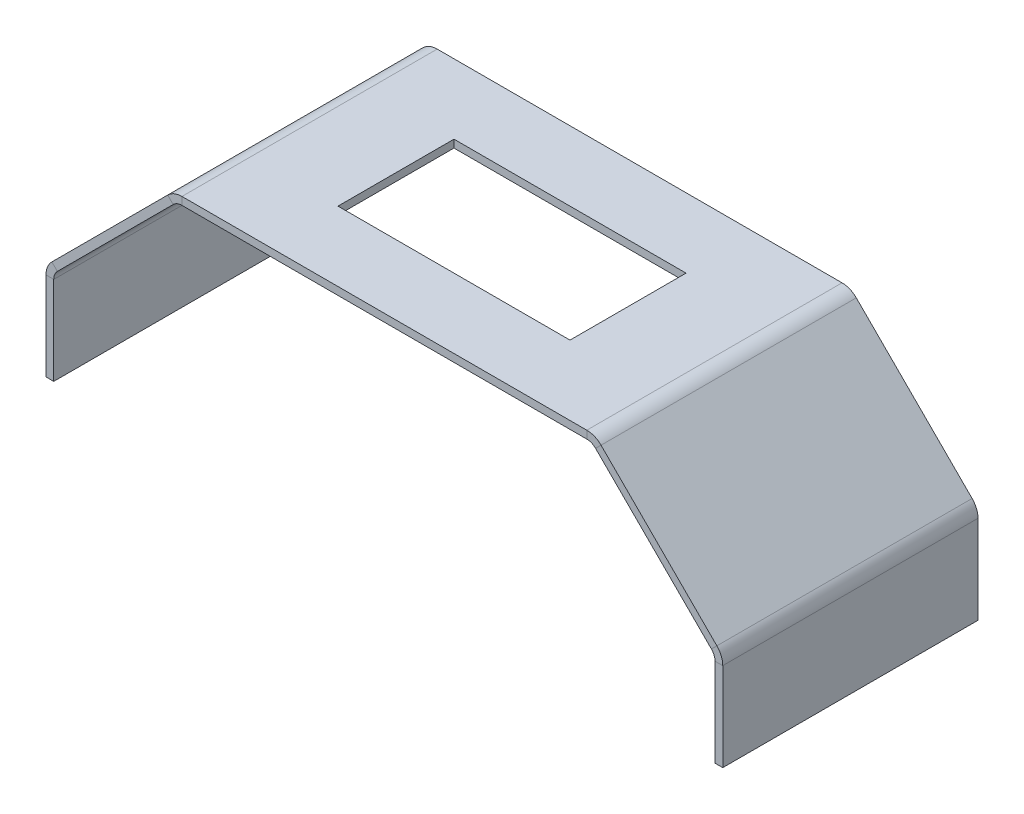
ISO-10303-21;
HEADER;
FILE_DESCRIPTION(('STEP AP214'),'2;1');
FILE_NAME('part.step','',(''),(''),'','','');
FILE_SCHEMA(('AUTOMOTIVE_DESIGN { 1 0 10303 214 1 1 1 1 }'));
ENDSEC;
DATA;
#1=APPLICATION_CONTEXT('core data for automotive mechanical design processes');
#2=APPLICATION_PROTOCOL_DEFINITION('international standard','automotive_design',2000,#1);
#3=PRODUCT_CONTEXT('',#1,'mechanical');
#4=PRODUCT('Part','Part','',(#3));
#5=PRODUCT_RELATED_PRODUCT_CATEGORY('part','',(#4));
#6=PRODUCT_DEFINITION_FORMATION('','',#4);
#7=PRODUCT_DEFINITION_CONTEXT('part definition',#1,'design');
#8=PRODUCT_DEFINITION('design','',#6,#7);
#9=PRODUCT_DEFINITION_SHAPE('','',#8);
#10=(LENGTH_UNIT() NAMED_UNIT(*) SI_UNIT(.MILLI.,.METRE.));
#11=(NAMED_UNIT(*) PLANE_ANGLE_UNIT() SI_UNIT($,.RADIAN.));
#12=(NAMED_UNIT(*) SI_UNIT($,.STERADIAN.) SOLID_ANGLE_UNIT());
#13=UNCERTAINTY_MEASURE_WITH_UNIT(LENGTH_MEASURE(1.E-05),#10,'distance_accuracy_value','');
#14=(GEOMETRIC_REPRESENTATION_CONTEXT(3) GLOBAL_UNCERTAINTY_ASSIGNED_CONTEXT((#13)) GLOBAL_UNIT_ASSIGNED_CONTEXT((#10,
#11,#12)) REPRESENTATION_CONTEXT('',''));
#15=CARTESIAN_POINT('',(0.,0.,0.));
#16=DIRECTION('',(0.,0.,1.));
#17=DIRECTION('',(1.,0.,0.));
#18=AXIS2_PLACEMENT_3D('',#15,#16,#17);
#19=CARTESIAN_POINT('',(1.52304473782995,26.52304473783,66.));
#20=DIRECTION('',(0.,0.,1.));
#21=DIRECTION('',(1.,0.,0.));
#22=AXIS2_PLACEMENT_3D('',#19,#20,#21);
#23=PLANE('',#22);
#24=DIRECTION('',(0.707106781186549,-0.707106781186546,0.));
#25=VECTOR('',#24,1.);
#26=CARTESIAN_POINT('',(1.52304473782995,26.52304473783,66.));
#27=LINE('',#26,#25);
#28=CARTESIAN_POINT('',(1.52304473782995,26.52304473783,66.));
#29=VERTEX_POINT('',#28);
#30=CARTESIAN_POINT('',(2.93725830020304,25.1088311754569,66.));
#31=VERTEX_POINT('',#30);
#32=EDGE_CURVE('E428',#29,#31,#27,.T.);
#33=ORIENTED_EDGE('',*,*,#32,.F.);
#34=CARTESIAN_POINT('',(5.2,22.8460894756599,66.));
#35=DIRECTION('',(0.,0.,1.));
#36=DIRECTION('',(1.,0.,0.));
#37=AXIS2_PLACEMENT_3D('',#34,#35,#36);
#38=CIRCLE('',#37,5.2);
#39=CARTESIAN_POINT('',(0.,22.8460894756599,66.));
#40=VERTEX_POINT('',#39);
#41=EDGE_CURVE('E251',#40,#29,#38,.F.);
#42=ORIENTED_EDGE('',*,*,#41,.F.);
#43=DIRECTION('',(-1.,0.,0.));
#44=VECTOR('',#43,1.);
#45=CARTESIAN_POINT('',(2.,22.8460894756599,66.));
#46=LINE('',#45,#44);
#47=CARTESIAN_POINT('',(2.,22.8460894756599,66.));
#48=VERTEX_POINT('',#47);
#49=EDGE_CURVE('E426',#48,#40,#46,.T.);
#50=ORIENTED_EDGE('',*,*,#49,.F.);
#51=CARTESIAN_POINT('',(5.2,22.8460894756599,66.));
#52=DIRECTION('',(0.,0.,1.));
#53=DIRECTION('',(1.,0.,0.));
#54=AXIS2_PLACEMENT_3D('',#51,#52,#53);
#55=CIRCLE('',#54,3.2);
#56=EDGE_CURVE('E263',#48,#31,#55,.F.);
#57=ORIENTED_EDGE('',*,*,#56,.T.);
#58=EDGE_LOOP('',(#33,#42,#50,#57));
#59=FACE_BOUND('',#58,.T.);
#60=ADVANCED_FACE('F35',(#59),#23,.T.);
#61=CARTESIAN_POINT('',(2.,22.8460894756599,66.));
#62=DIRECTION('',(0.,0.,1.));
#63=DIRECTION('',(1.,0.,0.));
#64=AXIS2_PLACEMENT_3D('',#61,#62,#63);
#65=PLANE('',#64);
#66=DIRECTION('',(0.707106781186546,0.707106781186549,0.));
#67=VECTOR('',#66,1.);
#68=CARTESIAN_POINT('',(0.,25.,66.));
#69=LINE('',#68,#67);
#70=CARTESIAN_POINT('',(31.4769552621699,56.4769552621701,66.));
#71=VERTEX_POINT('',#70);
#72=EDGE_CURVE('E248',#29,#71,#69,.T.);
#73=ORIENTED_EDGE('',*,*,#72,.F.);
#74=ORIENTED_EDGE('',*,*,#32,.T.);
#75=DIRECTION('',(0.707106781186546,0.707106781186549,0.));
#76=VECTOR('',#75,1.);
#77=CARTESIAN_POINT('',(1.4142135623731,23.5857864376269,66.));
#78=LINE('',#77,#76);
#79=CARTESIAN_POINT('',(32.891168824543,55.062741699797,66.));
#80=VERTEX_POINT('',#79);
#81=EDGE_CURVE('E266',#31,#80,#78,.T.);
#82=ORIENTED_EDGE('',*,*,#81,.T.);
#83=DIRECTION('',(-0.707106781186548,0.707106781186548,0.));
#84=VECTOR('',#83,1.);
#85=CARTESIAN_POINT('',(32.891168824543,55.062741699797,66.));
#86=LINE('',#85,#84);
#87=EDGE_CURVE('E418',#80,#71,#86,.T.);
#88=ORIENTED_EDGE('',*,*,#87,.T.);
#89=EDGE_LOOP('',(#73,#74,#82,#88));
#90=FACE_BOUND('',#89,.T.);
#91=ADVANCED_FACE('F454',(#90),#65,.T.);
#92=CARTESIAN_POINT('',(0.,22.8460894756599,0.));
#93=DIRECTION('',(0.,0.,-1.));
#94=DIRECTION('',(-1.,0.,0.));
#95=AXIS2_PLACEMENT_3D('',#92,#93,#94);
#96=PLANE('',#95);
#97=DIRECTION('',(1.,0.,0.));
#98=VECTOR('',#97,1.);
#99=CARTESIAN_POINT('',(0.,22.8460894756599,0.));
#100=LINE('',#99,#98);
#101=CARTESIAN_POINT('',(0.,22.8460894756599,0.));
#102=VERTEX_POINT('',#101);
#103=CARTESIAN_POINT('',(2.,22.8460894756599,0.));
#104=VERTEX_POINT('',#103);
#105=EDGE_CURVE('E424',#102,#104,#100,.T.);
#106=ORIENTED_EDGE('',*,*,#105,.F.);
#107=CARTESIAN_POINT('',(5.2,22.8460894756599,0.));
#108=DIRECTION('',(0.,0.,1.));
#109=DIRECTION('',(1.,0.,0.));
#110=AXIS2_PLACEMENT_3D('',#107,#108,#109);
#111=CIRCLE('',#110,5.2);
#112=CARTESIAN_POINT('',(1.52304473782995,26.52304473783,0.));
#113=VERTEX_POINT('',#112);
#114=EDGE_CURVE('E311',#102,#113,#111,.F.);
#115=ORIENTED_EDGE('',*,*,#114,.T.);
#116=DIRECTION('',(-0.707106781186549,0.707106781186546,0.));
#117=VECTOR('',#116,1.);
#118=CARTESIAN_POINT('',(2.93725830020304,25.1088311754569,0.));
#119=LINE('',#118,#117);
#120=CARTESIAN_POINT('',(2.93725830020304,25.1088311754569,0.));
#121=VERTEX_POINT('',#120);
#122=EDGE_CURVE('E422',#121,#113,#119,.T.);
#123=ORIENTED_EDGE('',*,*,#122,.F.);
#124=CARTESIAN_POINT('',(5.2,22.8460894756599,0.));
#125=DIRECTION('',(0.,0.,1.));
#126=DIRECTION('',(1.,0.,0.));
#127=AXIS2_PLACEMENT_3D('',#124,#125,#126);
#128=CIRCLE('',#127,3.2);
#129=EDGE_CURVE('E323',#104,#121,#128,.F.);
#130=ORIENTED_EDGE('',*,*,#129,.F.);
#131=EDGE_LOOP('',(#106,#115,#123,#130));
#132=FACE_BOUND('',#131,.T.);
#133=ADVANCED_FACE('F459',(#132),#96,.T.);
#134=CARTESIAN_POINT('',(2.93725830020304,25.1088311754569,0.));
#135=DIRECTION('',(0.,0.,-1.));
#136=DIRECTION('',(-1.,0.,0.));
#137=AXIS2_PLACEMENT_3D('',#134,#135,#136);
#138=PLANE('',#137);
#139=DIRECTION('',(0.,1.,0.));
#140=VECTOR('',#139,1.);
#141=CARTESIAN_POINT('',(0.,0.,0.));
#142=LINE('',#141,#140);
#143=CARTESIAN_POINT('',(0.,0.,0.));
#144=VERTEX_POINT('',#143);
#145=EDGE_CURVE('E314',#144,#102,#142,.T.);
#146=ORIENTED_EDGE('',*,*,#145,.T.);
#147=ORIENTED_EDGE('',*,*,#105,.T.);
#148=DIRECTION('',(0.,1.,0.));
#149=VECTOR('',#148,1.);
#150=CARTESIAN_POINT('',(2.,0.,0.));
#151=LINE('',#150,#149);
#152=CARTESIAN_POINT('',(2.,0.,0.));
#153=VERTEX_POINT('',#152);
#154=EDGE_CURVE('E320',#153,#104,#151,.T.);
#155=ORIENTED_EDGE('',*,*,#154,.F.);
#156=DIRECTION('',(-1.,0.,0.));
#157=VECTOR('',#156,1.);
#158=CARTESIAN_POINT('',(2.,0.,0.));
#159=LINE('',#158,#157);
#160=EDGE_CURVE('E317',#153,#144,#159,.T.);
#161=ORIENTED_EDGE('',*,*,#160,.T.);
#162=EDGE_LOOP('',(#146,#147,#155,#161));
#163=FACE_BOUND('',#162,.T.);
#164=ADVANCED_FACE('F515',(#163),#138,.T.);
#165=CARTESIAN_POINT('',(35.15391052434,58.,66.));
#166=DIRECTION('',(0.,0.,1.));
#167=DIRECTION('',(1.,0.,0.));
#168=AXIS2_PLACEMENT_3D('',#165,#166,#167);
#169=PLANE('',#168);
#170=DIRECTION('',(0.,-1.,0.));
#171=VECTOR('',#170,1.);
#172=CARTESIAN_POINT('',(35.15391052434,58.,66.));
#173=LINE('',#172,#171);
#174=CARTESIAN_POINT('',(35.15391052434,58.,66.));
#175=VERTEX_POINT('',#174);
#176=CARTESIAN_POINT('',(35.15391052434,56.,66.));
#177=VERTEX_POINT('',#176);
#178=EDGE_CURVE('E420',#175,#177,#173,.T.);
#179=ORIENTED_EDGE('',*,*,#178,.F.);
#180=CARTESIAN_POINT('',(35.15391052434,52.8,66.));
#181=DIRECTION('',(0.,0.,1.));
#182=DIRECTION('',(1.,0.,0.));
#183=AXIS2_PLACEMENT_3D('',#180,#181,#182);
#184=CIRCLE('',#183,5.2);
#185=EDGE_CURVE('E245',#71,#175,#184,.F.);
#186=ORIENTED_EDGE('',*,*,#185,.F.);
#187=ORIENTED_EDGE('',*,*,#87,.F.);
#188=CARTESIAN_POINT('',(35.15391052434,52.8,66.));
#189=DIRECTION('',(0.,0.,1.));
#190=DIRECTION('',(1.,0.,0.));
#191=AXIS2_PLACEMENT_3D('',#188,#189,#190);
#192=CIRCLE('',#191,3.2);
#193=EDGE_CURVE('E269',#80,#177,#192,.F.);
#194=ORIENTED_EDGE('',*,*,#193,.T.);
#195=EDGE_LOOP('',(#179,#186,#187,#194));
#196=FACE_BOUND('',#195,.T.);
#197=ADVANCED_FACE('F503',(#196),#169,.T.);
#198=CARTESIAN_POINT('',(32.891168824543,55.062741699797,66.));
#199=DIRECTION('',(0.,0.,1.));
#200=DIRECTION('',(1.,0.,0.));
#201=AXIS2_PLACEMENT_3D('',#198,#199,#200);
#202=PLANE('',#201);
#203=DIRECTION('',(1.,0.,0.));
#204=VECTOR('',#203,1.);
#205=CARTESIAN_POINT('',(32.9999999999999,58.,66.));
#206=LINE('',#205,#204);
#207=CARTESIAN_POINT('',(139.84608947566,58.,66.));
#208=VERTEX_POINT('',#207);
#209=EDGE_CURVE('E242',#175,#208,#206,.T.);
#210=ORIENTED_EDGE('',*,*,#209,.F.);
#211=ORIENTED_EDGE('',*,*,#178,.T.);
#212=DIRECTION('',(1.,0.,0.));
#213=VECTOR('',#212,1.);
#214=CARTESIAN_POINT('',(32.9999999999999,56.,66.));
#215=LINE('',#214,#213);
#216=CARTESIAN_POINT('',(139.84608947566,56.,66.));
#217=VERTEX_POINT('',#216);
#218=EDGE_CURVE('E272',#177,#217,#215,.T.);
#219=ORIENTED_EDGE('',*,*,#218,.T.);
#220=DIRECTION('',(0.,1.,0.));
#221=VECTOR('',#220,1.);
#222=CARTESIAN_POINT('',(139.84608947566,56.,66.));
#223=LINE('',#222,#221);
#224=EDGE_CURVE('E410',#217,#208,#223,.T.);
#225=ORIENTED_EDGE('',*,*,#224,.T.);
#226=EDGE_LOOP('',(#210,#211,#219,#225));
#227=FACE_BOUND('',#226,.T.);
#228=ADVANCED_FACE('F522',(#227),#202,.T.);
#229=CARTESIAN_POINT('',(31.4769552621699,56.4769552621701,0.));
#230=DIRECTION('',(0.,0.,-1.));
#231=DIRECTION('',(-1.,0.,0.));
#232=AXIS2_PLACEMENT_3D('',#229,#230,#231);
#233=PLANE('',#232);
#234=DIRECTION('',(0.707106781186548,-0.707106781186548,0.));
#235=VECTOR('',#234,1.);
#236=CARTESIAN_POINT('',(31.4769552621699,56.4769552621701,0.));
#237=LINE('',#236,#235);
#238=CARTESIAN_POINT('',(31.4769552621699,56.4769552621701,0.));
#239=VERTEX_POINT('',#238);
#240=CARTESIAN_POINT('',(32.891168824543,55.062741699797,0.));
#241=VERTEX_POINT('',#240);
#242=EDGE_CURVE('E416',#239,#241,#237,.T.);
#243=ORIENTED_EDGE('',*,*,#242,.F.);
#244=CARTESIAN_POINT('',(35.15391052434,52.8,0.));
#245=DIRECTION('',(0.,0.,1.));
#246=DIRECTION('',(1.,0.,0.));
#247=AXIS2_PLACEMENT_3D('',#244,#245,#246);
#248=CIRCLE('',#247,5.2);
#249=CARTESIAN_POINT('',(35.15391052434,58.,0.));
#250=VERTEX_POINT('',#249);
#251=EDGE_CURVE('E305',#239,#250,#248,.F.);
#252=ORIENTED_EDGE('',*,*,#251,.T.);
#253=DIRECTION('',(0.,1.,0.));
#254=VECTOR('',#253,1.);
#255=CARTESIAN_POINT('',(35.15391052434,56.,0.));
#256=LINE('',#255,#254);
#257=CARTESIAN_POINT('',(35.15391052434,56.,0.));
#258=VERTEX_POINT('',#257);
#259=EDGE_CURVE('E414',#258,#250,#256,.T.);
#260=ORIENTED_EDGE('',*,*,#259,.F.);
#261=CARTESIAN_POINT('',(35.15391052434,52.8,0.));
#262=DIRECTION('',(0.,0.,1.));
#263=DIRECTION('',(1.,0.,0.));
#264=AXIS2_PLACEMENT_3D('',#261,#262,#263);
#265=CIRCLE('',#264,3.2);
#266=EDGE_CURVE('E329',#241,#258,#265,.F.);
#267=ORIENTED_EDGE('',*,*,#266,.F.);
#268=EDGE_LOOP('',(#243,#252,#260,#267));
#269=FACE_BOUND('',#268,.T.);
#270=ADVANCED_FACE('F528',(#269),#233,.T.);
#271=CARTESIAN_POINT('',(35.15391052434,56.,0.));
#272=DIRECTION('',(0.,0.,-1.));
#273=DIRECTION('',(-1.,0.,0.));
#274=AXIS2_PLACEMENT_3D('',#271,#272,#273);
#275=PLANE('',#274);
#276=DIRECTION('',(0.707106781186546,0.707106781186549,0.));
#277=VECTOR('',#276,1.);
#278=CARTESIAN_POINT('',(0.,25.,0.));
#279=LINE('',#278,#277);
#280=EDGE_CURVE('E308',#113,#239,#279,.T.);
#281=ORIENTED_EDGE('',*,*,#280,.T.);
#282=ORIENTED_EDGE('',*,*,#242,.T.);
#283=DIRECTION('',(0.707106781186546,0.707106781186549,0.));
#284=VECTOR('',#283,1.);
#285=CARTESIAN_POINT('',(1.4142135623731,23.5857864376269,0.));
#286=LINE('',#285,#284);
#287=EDGE_CURVE('E326',#121,#241,#286,.T.);
#288=ORIENTED_EDGE('',*,*,#287,.F.);
#289=ORIENTED_EDGE('',*,*,#122,.T.);
#290=EDGE_LOOP('',(#281,#282,#288,#289));
#291=FACE_BOUND('',#290,.T.);
#292=ADVANCED_FACE('F512',(#291),#275,.T.);
#293=CARTESIAN_POINT('',(143.52304473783,56.47695526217,66.));
#294=DIRECTION('',(0.,0.,1.));
#295=DIRECTION('',(1.,0.,0.));
#296=AXIS2_PLACEMENT_3D('',#293,#294,#295);
#297=PLANE('',#296);
#298=DIRECTION('',(-0.707106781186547,-0.707106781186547,0.));
#299=VECTOR('',#298,1.);
#300=CARTESIAN_POINT('',(143.52304473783,56.47695526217,66.));
#301=LINE('',#300,#299);
#302=CARTESIAN_POINT('',(143.52304473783,56.47695526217,66.));
#303=VERTEX_POINT('',#302);
#304=CARTESIAN_POINT('',(142.108831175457,55.0627416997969,66.));
#305=VERTEX_POINT('',#304);
#306=EDGE_CURVE('E412',#303,#305,#301,.T.);
#307=ORIENTED_EDGE('',*,*,#306,.F.);
#308=CARTESIAN_POINT('',(139.84608947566,52.8,66.));
#309=DIRECTION('',(0.,0.,1.));
#310=DIRECTION('',(1.,0.,0.));
#311=AXIS2_PLACEMENT_3D('',#308,#309,#310);
#312=CIRCLE('',#311,5.2);
#313=EDGE_CURVE('E239',#208,#303,#312,.F.);
#314=ORIENTED_EDGE('',*,*,#313,.F.);
#315=ORIENTED_EDGE('',*,*,#224,.F.);
#316=CARTESIAN_POINT('',(139.84608947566,52.8,66.));
#317=DIRECTION('',(0.,0.,1.));
#318=DIRECTION('',(1.,0.,0.));
#319=AXIS2_PLACEMENT_3D('',#316,#317,#318);
#320=CIRCLE('',#319,3.2);
#321=EDGE_CURVE('E275',#217,#305,#320,.F.);
#322=ORIENTED_EDGE('',*,*,#321,.T.);
#323=EDGE_LOOP('',(#307,#314,#315,#322));
#324=FACE_BOUND('',#323,.T.);
#325=ADVANCED_FACE('F534',(#324),#297,.T.);
#326=CARTESIAN_POINT('',(139.84608947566,56.,66.));
#327=DIRECTION('',(0.,0.,1.));
#328=DIRECTION('',(1.,0.,0.));
#329=AXIS2_PLACEMENT_3D('',#326,#327,#328);
#330=PLANE('',#329);
#331=DIRECTION('',(0.707106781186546,-0.707106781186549,0.));
#332=VECTOR('',#331,1.);
#333=CARTESIAN_POINT('',(142.,58.,66.));
#334=LINE('',#333,#332);
#335=CARTESIAN_POINT('',(173.47695526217,26.52304473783,66.));
#336=VERTEX_POINT('',#335);
#337=EDGE_CURVE('E236',#303,#336,#334,.T.);
#338=ORIENTED_EDGE('',*,*,#337,.F.);
#339=ORIENTED_EDGE('',*,*,#306,.T.);
#340=DIRECTION('',(0.707106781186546,-0.707106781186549,0.));
#341=VECTOR('',#340,1.);
#342=CARTESIAN_POINT('',(140.585786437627,56.5857864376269,66.));
#343=LINE('',#342,#341);
#344=CARTESIAN_POINT('',(172.062741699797,25.1088311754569,66.));
#345=VERTEX_POINT('',#344);
#346=EDGE_CURVE('E278',#305,#345,#343,.T.);
#347=ORIENTED_EDGE('',*,*,#346,.T.);
#348=DIRECTION('',(0.707106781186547,0.707106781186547,0.));
#349=VECTOR('',#348,1.);
#350=CARTESIAN_POINT('',(172.062741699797,25.1088311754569,66.));
#351=LINE('',#350,#349);
#352=EDGE_CURVE('E402',#345,#336,#351,.T.);
#353=ORIENTED_EDGE('',*,*,#352,.T.);
#354=EDGE_LOOP('',(#338,#339,#347,#353));
#355=FACE_BOUND('',#354,.T.);
#356=ADVANCED_FACE('F537',(#355),#330,.T.);
#357=CARTESIAN_POINT('',(139.84608947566,58.,0.));
#358=DIRECTION('',(0.,0.,-1.));
#359=DIRECTION('',(-1.,0.,0.));
#360=AXIS2_PLACEMENT_3D('',#357,#358,#359);
#361=PLANE('',#360);
#362=DIRECTION('',(0.,-1.,0.));
#363=VECTOR('',#362,1.);
#364=CARTESIAN_POINT('',(139.84608947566,58.,0.));
#365=LINE('',#364,#363);
#366=CARTESIAN_POINT('',(139.84608947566,58.,0.));
#367=VERTEX_POINT('',#366);
#368=CARTESIAN_POINT('',(139.84608947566,56.,0.));
#369=VERTEX_POINT('',#368);
#370=EDGE_CURVE('E408',#367,#369,#365,.T.);
#371=ORIENTED_EDGE('',*,*,#370,.F.);
#372=CARTESIAN_POINT('',(139.84608947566,52.8,0.));
#373=DIRECTION('',(0.,0.,1.));
#374=DIRECTION('',(1.,0.,0.));
#375=AXIS2_PLACEMENT_3D('',#372,#373,#374);
#376=CIRCLE('',#375,5.2);
#377=CARTESIAN_POINT('',(143.52304473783,56.47695526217,0.));
#378=VERTEX_POINT('',#377);
#379=EDGE_CURVE('E299',#367,#378,#376,.F.);
#380=ORIENTED_EDGE('',*,*,#379,.T.);
#381=DIRECTION('',(0.707106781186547,0.707106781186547,0.));
#382=VECTOR('',#381,1.);
#383=CARTESIAN_POINT('',(142.108831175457,55.0627416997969,0.));
#384=LINE('',#383,#382);
#385=CARTESIAN_POINT('',(142.108831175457,55.0627416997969,0.));
#386=VERTEX_POINT('',#385);
#387=EDGE_CURVE('E406',#386,#378,#384,.T.);
#388=ORIENTED_EDGE('',*,*,#387,.F.);
#389=CARTESIAN_POINT('',(139.84608947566,52.8,0.));
#390=DIRECTION('',(0.,0.,1.));
#391=DIRECTION('',(1.,0.,0.));
#392=AXIS2_PLACEMENT_3D('',#389,#390,#391);
#393=CIRCLE('',#392,3.2);
#394=EDGE_CURVE('E335',#369,#386,#393,.F.);
#395=ORIENTED_EDGE('',*,*,#394,.F.);
#396=EDGE_LOOP('',(#371,#380,#388,#395));
#397=FACE_BOUND('',#396,.T.);
#398=ADVANCED_FACE('F541',(#397),#361,.T.);
#399=CARTESIAN_POINT('',(142.108831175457,55.0627416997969,0.));
#400=DIRECTION('',(0.,0.,-1.));
#401=DIRECTION('',(-1.,0.,0.));
#402=AXIS2_PLACEMENT_3D('',#399,#400,#401);
#403=PLANE('',#402);
#404=DIRECTION('',(1.,0.,0.));
#405=VECTOR('',#404,1.);
#406=CARTESIAN_POINT('',(32.9999999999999,58.,0.));
#407=LINE('',#406,#405);
#408=EDGE_CURVE('E302',#250,#367,#407,.T.);
#409=ORIENTED_EDGE('',*,*,#408,.T.);
#410=ORIENTED_EDGE('',*,*,#370,.T.);
#411=DIRECTION('',(1.,0.,0.));
#412=VECTOR('',#411,1.);
#413=CARTESIAN_POINT('',(32.9999999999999,56.,0.));
#414=LINE('',#413,#412);
#415=EDGE_CURVE('E332',#258,#369,#414,.T.);
#416=ORIENTED_EDGE('',*,*,#415,.F.);
#417=ORIENTED_EDGE('',*,*,#259,.T.);
#418=EDGE_LOOP('',(#409,#410,#416,#417));
#419=FACE_BOUND('',#418,.T.);
#420=ADVANCED_FACE('F545',(#419),#403,.T.);
#421=CARTESIAN_POINT('',(175.,22.8460894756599,66.));
#422=DIRECTION('',(0.,0.,1.));
#423=DIRECTION('',(1.,0.,0.));
#424=AXIS2_PLACEMENT_3D('',#421,#422,#423);
#425=PLANE('',#424);
#426=DIRECTION('',(-1.,0.,0.));
#427=VECTOR('',#426,1.);
#428=CARTESIAN_POINT('',(175.,22.8460894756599,66.));
#429=LINE('',#428,#427);
#430=CARTESIAN_POINT('',(175.,22.8460894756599,66.));
#431=VERTEX_POINT('',#430);
#432=CARTESIAN_POINT('',(173.,22.8460894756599,66.));
#433=VERTEX_POINT('',#432);
#434=EDGE_CURVE('E404',#431,#433,#429,.T.);
#435=ORIENTED_EDGE('',*,*,#434,.F.);
#436=CARTESIAN_POINT('',(169.8,22.8460894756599,66.));
#437=DIRECTION('',(0.,0.,1.));
#438=DIRECTION('',(1.,0.,0.));
#439=AXIS2_PLACEMENT_3D('',#436,#437,#438);
#440=CIRCLE('',#439,5.2);
#441=EDGE_CURVE('E233',#336,#431,#440,.F.);
#442=ORIENTED_EDGE('',*,*,#441,.F.);
#443=ORIENTED_EDGE('',*,*,#352,.F.);
#444=CARTESIAN_POINT('',(169.8,22.8460894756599,66.));
#445=DIRECTION('',(0.,0.,1.));
#446=DIRECTION('',(1.,0.,0.));
#447=AXIS2_PLACEMENT_3D('',#444,#445,#446);
#448=CIRCLE('',#447,3.2);
#449=EDGE_CURVE('E281',#345,#433,#448,.F.);
#450=ORIENTED_EDGE('',*,*,#449,.T.);
#451=EDGE_LOOP('',(#435,#442,#443,#450));
#452=FACE_BOUND('',#451,.T.);
#453=ADVANCED_FACE('F549',(#452),#425,.T.);
#454=CARTESIAN_POINT('',(172.062741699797,25.1088311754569,66.));
#455=DIRECTION('',(0.,0.,1.));
#456=DIRECTION('',(1.,0.,0.));
#457=AXIS2_PLACEMENT_3D('',#454,#455,#456);
#458=PLANE('',#457);
#459=DIRECTION('',(0.,-1.,0.));
#460=VECTOR('',#459,1.);
#461=CARTESIAN_POINT('',(175.,25.,66.));
#462=LINE('',#461,#460);
#463=CARTESIAN_POINT('',(175.,0.,66.));
#464=VERTEX_POINT('',#463);
#465=EDGE_CURVE('E230',#431,#464,#462,.T.);
#466=ORIENTED_EDGE('',*,*,#465,.F.);
#467=ORIENTED_EDGE('',*,*,#434,.T.);
#468=DIRECTION('',(0.,1.,0.));
#469=VECTOR('',#468,1.);
#470=CARTESIAN_POINT('',(173.,25.,66.));
#471=LINE('',#470,#469);
#472=CARTESIAN_POINT('',(173.,0.,66.));
#473=VERTEX_POINT('',#472);
#474=EDGE_CURVE('E224',#433,#473,#471,.F.);
#475=ORIENTED_EDGE('',*,*,#474,.T.);
#476=DIRECTION('',(-1.,0.,0.));
#477=VECTOR('',#476,1.);
#478=CARTESIAN_POINT('',(175.,0.,66.));
#479=LINE('',#478,#477);
#480=EDGE_CURVE('E226',#464,#473,#479,.T.);
#481=ORIENTED_EDGE('',*,*,#480,.F.);
#482=EDGE_LOOP('',(#466,#467,#475,#481));
#483=FACE_BOUND('',#482,.T.);
#484=ADVANCED_FACE('F553',(#483),#458,.T.);
#485=CARTESIAN_POINT('',(173.47695526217,26.52304473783,0.));
#486=DIRECTION('',(0.,0.,-1.));
#487=DIRECTION('',(-1.,0.,0.));
#488=AXIS2_PLACEMENT_3D('',#485,#486,#487);
#489=PLANE('',#488);
#490=DIRECTION('',(-0.707106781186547,-0.707106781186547,0.));
#491=VECTOR('',#490,1.);
#492=CARTESIAN_POINT('',(173.47695526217,26.52304473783,0.));
#493=LINE('',#492,#491);
#494=CARTESIAN_POINT('',(173.47695526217,26.52304473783,0.));
#495=VERTEX_POINT('',#494);
#496=CARTESIAN_POINT('',(172.062741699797,25.1088311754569,0.));
#497=VERTEX_POINT('',#496);
#498=EDGE_CURVE('E400',#495,#497,#493,.T.);
#499=ORIENTED_EDGE('',*,*,#498,.F.);
#500=CARTESIAN_POINT('',(169.8,22.8460894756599,0.));
#501=DIRECTION('',(0.,0.,1.));
#502=DIRECTION('',(1.,0.,0.));
#503=AXIS2_PLACEMENT_3D('',#500,#501,#502);
#504=CIRCLE('',#503,5.2);
#505=CARTESIAN_POINT('',(175.,22.8460894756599,0.));
#506=VERTEX_POINT('',#505);
#507=EDGE_CURVE('E293',#495,#506,#504,.F.);
#508=ORIENTED_EDGE('',*,*,#507,.T.);
#509=DIRECTION('',(1.,0.,0.));
#510=VECTOR('',#509,1.);
#511=CARTESIAN_POINT('',(173.,22.8460894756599,0.));
#512=LINE('',#511,#510);
#513=CARTESIAN_POINT('',(173.,22.8460894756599,0.));
#514=VERTEX_POINT('',#513);
#515=EDGE_CURVE('E398',#514,#506,#512,.T.);
#516=ORIENTED_EDGE('',*,*,#515,.F.);
#517=CARTESIAN_POINT('',(169.8,22.8460894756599,0.));
#518=DIRECTION('',(0.,0.,1.));
#519=DIRECTION('',(1.,0.,0.));
#520=AXIS2_PLACEMENT_3D('',#517,#518,#519);
#521=CIRCLE('',#520,3.2);
#522=EDGE_CURVE('E227',#497,#514,#521,.F.);
#523=ORIENTED_EDGE('',*,*,#522,.F.);
#524=EDGE_LOOP('',(#499,#508,#516,#523));
#525=FACE_BOUND('',#524,.T.);
#526=ADVANCED_FACE('F557',(#525),#489,.T.);
#527=CARTESIAN_POINT('',(173.,22.8460894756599,0.));
#528=DIRECTION('',(0.,0.,-1.));
#529=DIRECTION('',(-1.,0.,0.));
#530=AXIS2_PLACEMENT_3D('',#527,#528,#529);
#531=PLANE('',#530);
#532=DIRECTION('',(0.707106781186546,-0.707106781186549,0.));
#533=VECTOR('',#532,1.);
#534=CARTESIAN_POINT('',(142.,58.,0.));
#535=LINE('',#534,#533);
#536=EDGE_CURVE('E296',#378,#495,#535,.T.);
#537=ORIENTED_EDGE('',*,*,#536,.T.);
#538=ORIENTED_EDGE('',*,*,#498,.T.);
#539=DIRECTION('',(0.707106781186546,-0.707106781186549,0.));
#540=VECTOR('',#539,1.);
#541=CARTESIAN_POINT('',(140.585786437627,56.5857864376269,0.));
#542=LINE('',#541,#540);
#543=EDGE_CURVE('E338',#386,#497,#542,.T.);
#544=ORIENTED_EDGE('',*,*,#543,.F.);
#545=ORIENTED_EDGE('',*,*,#387,.T.);
#546=EDGE_LOOP('',(#537,#538,#544,#545));
#547=FACE_BOUND('',#546,.T.);
#548=ADVANCED_FACE('F561',(#547),#531,.T.);
#549=CARTESIAN_POINT('',(173.,25.,66.));
#550=DIRECTION('',(1.,0.,0.));
#551=DIRECTION('',(0.,0.,-1.));
#552=AXIS2_PLACEMENT_3D('',#549,#550,#551);
#553=PLANE('',#552);
#554=DIRECTION('',(0.,1.,0.));
#555=VECTOR('',#554,1.);
#556=CARTESIAN_POINT('',(173.,25.,0.));
#557=LINE('',#556,#555);
#558=CARTESIAN_POINT('',(173.,0.,0.));
#559=VERTEX_POINT('',#558);
#560=EDGE_CURVE('E221',#514,#559,#557,.F.);
#561=ORIENTED_EDGE('',*,*,#560,.T.);
#562=DIRECTION('',(0.,0.,-1.));
#563=VECTOR('',#562,1.);
#564=CARTESIAN_POINT('',(173.,0.,66.));
#565=LINE('',#564,#563);
#566=EDGE_CURVE('E396',#473,#559,#565,.T.);
#567=ORIENTED_EDGE('',*,*,#566,.F.);
#568=ORIENTED_EDGE('',*,*,#474,.F.);
#569=DIRECTION('',(0.,0.,-1.));
#570=VECTOR('',#569,1.);
#571=CARTESIAN_POINT('',(173.,22.8460894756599,66.));
#572=LINE('',#571,#570);
#573=EDGE_CURVE('E284',#433,#514,#572,.T.);
#574=ORIENTED_EDGE('',*,*,#573,.T.);
#575=EDGE_LOOP('',(#561,#567,#568,#574));
#576=FACE_BOUND('',#575,.T.);
#577=ADVANCED_FACE('F565',(#576),#553,.F.);
#578=CARTESIAN_POINT('',(175.,0.,66.));
#579=DIRECTION('',(0.,-1.,0.));
#580=DIRECTION('',(0.,0.,-1.));
#581=AXIS2_PLACEMENT_3D('',#578,#579,#580);
#582=PLANE('',#581);
#583=DIRECTION('',(-1.,0.,0.));
#584=VECTOR('',#583,1.);
#585=CARTESIAN_POINT('',(175.,0.,0.));
#586=LINE('',#585,#584);
#587=CARTESIAN_POINT('',(175.,0.,0.));
#588=VERTEX_POINT('',#587);
#589=EDGE_CURVE('E287',#588,#559,#586,.T.);
#590=ORIENTED_EDGE('',*,*,#589,.F.);
#591=DIRECTION('',(0.,0.,-1.));
#592=VECTOR('',#591,1.);
#593=CARTESIAN_POINT('',(175.,0.,66.));
#594=LINE('',#593,#592);
#595=EDGE_CURVE('E394',#464,#588,#594,.T.);
#596=ORIENTED_EDGE('',*,*,#595,.F.);
#597=ORIENTED_EDGE('',*,*,#480,.T.);
#598=ORIENTED_EDGE('',*,*,#566,.T.);
#599=EDGE_LOOP('',(#590,#596,#597,#598));
#600=FACE_BOUND('',#599,.T.);
#601=ADVANCED_FACE('F569',(#600),#582,.T.);
#602=CARTESIAN_POINT('',(175.,25.,66.));
#603=DIRECTION('',(1.,0.,0.));
#604=DIRECTION('',(0.,0.,-1.));
#605=AXIS2_PLACEMENT_3D('',#602,#603,#604);
#606=PLANE('',#605);
#607=DIRECTION('',(0.,-1.,0.));
#608=VECTOR('',#607,1.);
#609=CARTESIAN_POINT('',(175.,25.,0.));
#610=LINE('',#609,#608);
#611=EDGE_CURVE('E290',#506,#588,#610,.T.);
#612=ORIENTED_EDGE('',*,*,#611,.F.);
#613=DIRECTION('',(0.,0.,-1.));
#614=VECTOR('',#613,1.);
#615=CARTESIAN_POINT('',(175.,22.8460894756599,66.));
#616=LINE('',#615,#614);
#617=EDGE_CURVE('E391',#431,#506,#616,.T.);
#618=ORIENTED_EDGE('',*,*,#617,.F.);
#619=ORIENTED_EDGE('',*,*,#465,.T.);
#620=ORIENTED_EDGE('',*,*,#595,.T.);
#621=EDGE_LOOP('',(#612,#618,#619,#620));
#622=FACE_BOUND('',#621,.T.);
#623=ADVANCED_FACE('F573',(#622),#606,.T.);
#624=CARTESIAN_POINT('',(169.8,22.8460894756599,66.));
#625=DIRECTION('',(0.,0.,-1.));
#626=DIRECTION('',(-1.,0.,0.));
#627=AXIS2_PLACEMENT_3D('',#624,#625,#626);
#628=CYLINDRICAL_SURFACE('',#627,5.2);
#629=ORIENTED_EDGE('',*,*,#507,.F.);
#630=DIRECTION('',(0.,0.,-1.));
#631=VECTOR('',#630,1.);
#632=CARTESIAN_POINT('',(173.47695526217,26.52304473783,66.));
#633=LINE('',#632,#631);
#634=EDGE_CURVE('E388',#336,#495,#633,.T.);
#635=ORIENTED_EDGE('',*,*,#634,.F.);
#636=ORIENTED_EDGE('',*,*,#441,.T.);
#637=ORIENTED_EDGE('',*,*,#617,.T.);
#638=EDGE_LOOP('',(#629,#635,#636,#637));
#639=FACE_BOUND('',#638,.T.);
#640=ADVANCED_FACE('F577',(#639),#628,.T.);
#641=CARTESIAN_POINT('',(142.,58.,66.));
#642=DIRECTION('',(0.707106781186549,0.707106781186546,0.));
#643=DIRECTION('',(-0.707106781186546,0.707106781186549,0.));
#644=AXIS2_PLACEMENT_3D('',#641,#642,#643);
#645=PLANE('',#644);
#646=ORIENTED_EDGE('',*,*,#536,.F.);
#647=DIRECTION('',(0.,0.,-1.));
#648=VECTOR('',#647,1.);
#649=CARTESIAN_POINT('',(143.52304473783,56.47695526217,66.));
#650=LINE('',#649,#648);
#651=EDGE_CURVE('E385',#303,#378,#650,.T.);
#652=ORIENTED_EDGE('',*,*,#651,.F.);
#653=ORIENTED_EDGE('',*,*,#337,.T.);
#654=ORIENTED_EDGE('',*,*,#634,.T.);
#655=EDGE_LOOP('',(#646,#652,#653,#654));
#656=FACE_BOUND('',#655,.T.);
#657=ADVANCED_FACE('F581',(#656),#645,.T.);
#658=CARTESIAN_POINT('',(139.84608947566,52.8,66.));
#659=DIRECTION('',(0.,0.,-1.));
#660=DIRECTION('',(-1.,0.,0.));
#661=AXIS2_PLACEMENT_3D('',#658,#659,#660);
#662=CYLINDRICAL_SURFACE('',#661,5.2);
#663=ORIENTED_EDGE('',*,*,#379,.F.);
#664=DIRECTION('',(0.,0.,-1.));
#665=VECTOR('',#664,1.);
#666=CARTESIAN_POINT('',(139.84608947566,58.,66.));
#667=LINE('',#666,#665);
#668=EDGE_CURVE('E382',#208,#367,#667,.T.);
#669=ORIENTED_EDGE('',*,*,#668,.F.);
#670=ORIENTED_EDGE('',*,*,#313,.T.);
#671=ORIENTED_EDGE('',*,*,#651,.T.);
#672=EDGE_LOOP('',(#663,#669,#670,#671));
#673=FACE_BOUND('',#672,.T.);
#674=ADVANCED_FACE('F585',(#673),#662,.T.);
#675=CARTESIAN_POINT('',(32.9999999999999,58.,66.));
#676=DIRECTION('',(0.,1.,0.));
#677=DIRECTION('',(-1.,0.,0.));
#678=AXIS2_PLACEMENT_3D('',#675,#676,#677);
#679=PLANE('',#678);
#680=DIRECTION('',(0.,0.,1.));
#681=VECTOR('',#680,1.);
#682=CARTESIAN_POINT('',(57.5,58.,18.));
#683=LINE('',#682,#681);
#684=CARTESIAN_POINT('',(57.5,58.,18.));
#685=VERTEX_POINT('',#684);
#686=CARTESIAN_POINT('',(57.5,58.,48.));
#687=VERTEX_POINT('',#686);
#688=EDGE_CURVE('E49',#685,#687,#683,.T.);
#689=ORIENTED_EDGE('',*,*,#688,.F.);
#690=DIRECTION('',(-1.,0.,0.));
#691=VECTOR('',#690,1.);
#692=CARTESIAN_POINT('',(57.5,58.,18.));
#693=LINE('',#692,#691);
#694=CARTESIAN_POINT('',(117.5,58.,18.));
#695=VERTEX_POINT('',#694);
#696=EDGE_CURVE('E214',#695,#685,#693,.T.);
#697=ORIENTED_EDGE('',*,*,#696,.F.);
#698=DIRECTION('',(0.,0.,-1.));
#699=VECTOR('',#698,1.);
#700=CARTESIAN_POINT('',(117.5,58.,18.));
#701=LINE('',#700,#699);
#702=CARTESIAN_POINT('',(117.5,58.,48.));
#703=VERTEX_POINT('',#702);
#704=EDGE_CURVE('E198',#703,#695,#701,.T.);
#705=ORIENTED_EDGE('',*,*,#704,.F.);
#706=DIRECTION('',(1.,0.,0.));
#707=VECTOR('',#706,1.);
#708=CARTESIAN_POINT('',(57.5,58.,48.));
#709=LINE('',#708,#707);
#710=EDGE_CURVE('E207',#687,#703,#709,.T.);
#711=ORIENTED_EDGE('',*,*,#710,.F.);
#712=EDGE_LOOP('',(#689,#697,#705,#711));
#713=FACE_BOUND('',#712,.T.);
#714=ORIENTED_EDGE('',*,*,#408,.F.);
#715=DIRECTION('',(0.,0.,-1.));
#716=VECTOR('',#715,1.);
#717=CARTESIAN_POINT('',(35.15391052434,58.,66.));
#718=LINE('',#717,#716);
#719=EDGE_CURVE('E379',#175,#250,#718,.T.);
#720=ORIENTED_EDGE('',*,*,#719,.F.);
#721=ORIENTED_EDGE('',*,*,#209,.T.);
#722=ORIENTED_EDGE('',*,*,#668,.T.);
#723=EDGE_LOOP('',(#714,#720,#721,#722));
#724=FACE_BOUND('',#723,.T.);
#725=ADVANCED_FACE('F211',(#713,#724),#679,.T.);
#726=CARTESIAN_POINT('',(35.15391052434,52.8,66.));
#727=DIRECTION('',(0.,0.,-1.));
#728=DIRECTION('',(-1.,0.,0.));
#729=AXIS2_PLACEMENT_3D('',#726,#727,#728);
#730=CYLINDRICAL_SURFACE('',#729,5.2);
#731=ORIENTED_EDGE('',*,*,#251,.F.);
#732=DIRECTION('',(0.,0.,-1.));
#733=VECTOR('',#732,1.);
#734=CARTESIAN_POINT('',(31.4769552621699,56.4769552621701,66.));
#735=LINE('',#734,#733);
#736=EDGE_CURVE('E376',#71,#239,#735,.T.);
#737=ORIENTED_EDGE('',*,*,#736,.F.);
#738=ORIENTED_EDGE('',*,*,#185,.T.);
#739=ORIENTED_EDGE('',*,*,#719,.T.);
#740=EDGE_LOOP('',(#731,#737,#738,#739));
#741=FACE_BOUND('',#740,.T.);
#742=ADVANCED_FACE('F508',(#741),#730,.T.);
#743=CARTESIAN_POINT('',(0.,25.,66.));
#744=DIRECTION('',(-0.707106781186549,0.707106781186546,0.));
#745=DIRECTION('',(-0.707106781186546,-0.707106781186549,0.));
#746=AXIS2_PLACEMENT_3D('',#743,#744,#745);
#747=PLANE('',#746);
#748=ORIENTED_EDGE('',*,*,#280,.F.);
#749=DIRECTION('',(0.,0.,-1.));
#750=VECTOR('',#749,1.);
#751=CARTESIAN_POINT('',(1.52304473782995,26.52304473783,66.));
#752=LINE('',#751,#750);
#753=EDGE_CURVE('E373',#29,#113,#752,.T.);
#754=ORIENTED_EDGE('',*,*,#753,.F.);
#755=ORIENTED_EDGE('',*,*,#72,.T.);
#756=ORIENTED_EDGE('',*,*,#736,.T.);
#757=EDGE_LOOP('',(#748,#754,#755,#756));
#758=FACE_BOUND('',#757,.T.);
#759=ADVANCED_FACE('F468',(#758),#747,.T.);
#760=CARTESIAN_POINT('',(5.2,22.8460894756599,66.));
#761=DIRECTION('',(0.,0.,-1.));
#762=DIRECTION('',(-1.,0.,0.));
#763=AXIS2_PLACEMENT_3D('',#760,#761,#762);
#764=CYLINDRICAL_SURFACE('',#763,5.2);
#765=ORIENTED_EDGE('',*,*,#114,.F.);
#766=DIRECTION('',(0.,0.,-1.));
#767=VECTOR('',#766,1.);
#768=CARTESIAN_POINT('',(0.,22.8460894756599,66.));
#769=LINE('',#768,#767);
#770=EDGE_CURVE('E370',#40,#102,#769,.T.);
#771=ORIENTED_EDGE('',*,*,#770,.F.);
#772=ORIENTED_EDGE('',*,*,#41,.T.);
#773=ORIENTED_EDGE('',*,*,#753,.T.);
#774=EDGE_LOOP('',(#765,#771,#772,#773));
#775=FACE_BOUND('',#774,.T.);
#776=ADVANCED_FACE('F473',(#775),#764,.T.);
#777=CARTESIAN_POINT('',(0.,0.,66.));
#778=DIRECTION('',(-1.,0.,0.));
#779=DIRECTION('',(0.,0.,1.));
#780=AXIS2_PLACEMENT_3D('',#777,#778,#779);
#781=PLANE('',#780);
#782=ORIENTED_EDGE('',*,*,#145,.F.);
#783=DIRECTION('',(0.,0.,-1.));
#784=VECTOR('',#783,1.);
#785=CARTESIAN_POINT('',(0.,0.,66.));
#786=LINE('',#785,#784);
#787=CARTESIAN_POINT('',(0.,0.,66.));
#788=VERTEX_POINT('',#787);
#789=EDGE_CURVE('E368',#788,#144,#786,.T.);
#790=ORIENTED_EDGE('',*,*,#789,.F.);
#791=DIRECTION('',(0.,1.,0.));
#792=VECTOR('',#791,1.);
#793=CARTESIAN_POINT('',(0.,0.,66.));
#794=LINE('',#793,#792);
#795=EDGE_CURVE('E254',#788,#40,#794,.T.);
#796=ORIENTED_EDGE('',*,*,#795,.T.);
#797=ORIENTED_EDGE('',*,*,#770,.T.);
#798=EDGE_LOOP('',(#782,#790,#796,#797));
#799=FACE_BOUND('',#798,.T.);
#800=ADVANCED_FACE('F476',(#799),#781,.T.);
#801=CARTESIAN_POINT('',(2.,0.,66.));
#802=DIRECTION('',(0.,-1.,0.));
#803=DIRECTION('',(0.,0.,-1.));
#804=AXIS2_PLACEMENT_3D('',#801,#802,#803);
#805=PLANE('',#804);
#806=ORIENTED_EDGE('',*,*,#160,.F.);
#807=DIRECTION('',(0.,0.,-1.));
#808=VECTOR('',#807,1.);
#809=CARTESIAN_POINT('',(2.,0.,66.));
#810=LINE('',#809,#808);
#811=CARTESIAN_POINT('',(2.,0.,66.));
#812=VERTEX_POINT('',#811);
#813=EDGE_CURVE('E366',#812,#153,#810,.T.);
#814=ORIENTED_EDGE('',*,*,#813,.F.);
#815=DIRECTION('',(-1.,0.,0.));
#816=VECTOR('',#815,1.);
#817=CARTESIAN_POINT('',(2.,0.,66.));
#818=LINE('',#817,#816);
#819=EDGE_CURVE('E257',#812,#788,#818,.T.);
#820=ORIENTED_EDGE('',*,*,#819,.T.);
#821=ORIENTED_EDGE('',*,*,#789,.T.);
#822=EDGE_LOOP('',(#806,#814,#820,#821));
#823=FACE_BOUND('',#822,.T.);
#824=ADVANCED_FACE('F482',(#823),#805,.T.);
#825=CARTESIAN_POINT('',(2.,0.,66.));
#826=DIRECTION('',(-1.,0.,0.));
#827=DIRECTION('',(0.,0.,1.));
#828=AXIS2_PLACEMENT_3D('',#825,#826,#827);
#829=PLANE('',#828);
#830=ORIENTED_EDGE('',*,*,#154,.T.);
#831=DIRECTION('',(0.,0.,-1.));
#832=VECTOR('',#831,1.);
#833=CARTESIAN_POINT('',(2.,22.8460894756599,66.));
#834=LINE('',#833,#832);
#835=EDGE_CURVE('E363',#48,#104,#834,.T.);
#836=ORIENTED_EDGE('',*,*,#835,.F.);
#837=DIRECTION('',(0.,1.,0.));
#838=VECTOR('',#837,1.);
#839=CARTESIAN_POINT('',(2.,0.,66.));
#840=LINE('',#839,#838);
#841=EDGE_CURVE('E260',#812,#48,#840,.T.);
#842=ORIENTED_EDGE('',*,*,#841,.F.);
#843=ORIENTED_EDGE('',*,*,#813,.T.);
#844=EDGE_LOOP('',(#830,#836,#842,#843));
#845=FACE_BOUND('',#844,.T.);
#846=ADVANCED_FACE('F487',(#845),#829,.F.);
#847=CARTESIAN_POINT('',(5.2,22.8460894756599,66.));
#848=DIRECTION('',(0.,0.,-1.));
#849=DIRECTION('',(-1.,0.,0.));
#850=AXIS2_PLACEMENT_3D('',#847,#848,#849);
#851=CYLINDRICAL_SURFACE('',#850,3.2);
#852=ORIENTED_EDGE('',*,*,#129,.T.);
#853=DIRECTION('',(0.,0.,-1.));
#854=VECTOR('',#853,1.);
#855=CARTESIAN_POINT('',(2.93725830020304,25.1088311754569,66.));
#856=LINE('',#855,#854);
#857=EDGE_CURVE('E360',#31,#121,#856,.T.);
#858=ORIENTED_EDGE('',*,*,#857,.F.);
#859=ORIENTED_EDGE('',*,*,#56,.F.);
#860=ORIENTED_EDGE('',*,*,#835,.T.);
#861=EDGE_LOOP('',(#852,#858,#859,#860));
#862=FACE_BOUND('',#861,.T.);
#863=ADVANCED_FACE('F490',(#862),#851,.F.);
#864=CARTESIAN_POINT('',(1.4142135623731,23.5857864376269,66.));
#865=DIRECTION('',(-0.707106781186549,0.707106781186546,0.));
#866=DIRECTION('',(-0.707106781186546,-0.707106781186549,0.));
#867=AXIS2_PLACEMENT_3D('',#864,#865,#866);
#868=PLANE('',#867);
#869=ORIENTED_EDGE('',*,*,#287,.T.);
#870=DIRECTION('',(0.,0.,-1.));
#871=VECTOR('',#870,1.);
#872=CARTESIAN_POINT('',(32.891168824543,55.062741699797,66.));
#873=LINE('',#872,#871);
#874=EDGE_CURVE('E357',#80,#241,#873,.T.);
#875=ORIENTED_EDGE('',*,*,#874,.F.);
#876=ORIENTED_EDGE('',*,*,#81,.F.);
#877=ORIENTED_EDGE('',*,*,#857,.T.);
#878=EDGE_LOOP('',(#869,#875,#876,#877));
#879=FACE_BOUND('',#878,.T.);
#880=ADVANCED_FACE('F495',(#879),#868,.F.);
#881=CARTESIAN_POINT('',(35.15391052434,52.8,66.));
#882=DIRECTION('',(0.,0.,-1.));
#883=DIRECTION('',(-1.,0.,0.));
#884=AXIS2_PLACEMENT_3D('',#881,#882,#883);
#885=CYLINDRICAL_SURFACE('',#884,3.2);
#886=ORIENTED_EDGE('',*,*,#266,.T.);
#887=DIRECTION('',(0.,0.,-1.));
#888=VECTOR('',#887,1.);
#889=CARTESIAN_POINT('',(35.15391052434,56.,66.));
#890=LINE('',#889,#888);
#891=EDGE_CURVE('E354',#177,#258,#890,.T.);
#892=ORIENTED_EDGE('',*,*,#891,.F.);
#893=ORIENTED_EDGE('',*,*,#193,.F.);
#894=ORIENTED_EDGE('',*,*,#874,.T.);
#895=EDGE_LOOP('',(#886,#892,#893,#894));
#896=FACE_BOUND('',#895,.T.);
#897=ADVANCED_FACE('F500',(#896),#885,.F.);
#898=CARTESIAN_POINT('',(32.9999999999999,56.,66.));
#899=DIRECTION('',(0.,1.,0.));
#900=DIRECTION('',(-1.,0.,0.));
#901=AXIS2_PLACEMENT_3D('',#898,#899,#900);
#902=PLANE('',#901);
#903=DIRECTION('',(-1.,0.,0.));
#904=VECTOR('',#903,1.);
#905=CARTESIAN_POINT('',(32.9999999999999,56.,18.));
#906=LINE('',#905,#904);
#907=CARTESIAN_POINT('',(117.5,56.,18.));
#908=VERTEX_POINT('',#907);
#909=CARTESIAN_POINT('',(57.5,56.,18.));
#910=VERTEX_POINT('',#909);
#911=EDGE_CURVE('E42',#908,#910,#906,.T.);
#912=ORIENTED_EDGE('',*,*,#911,.T.);
#913=DIRECTION('',(0.,0.,1.));
#914=VECTOR('',#913,1.);
#915=CARTESIAN_POINT('',(57.5,56.,66.));
#916=LINE('',#915,#914);
#917=CARTESIAN_POINT('',(57.5,56.,48.));
#918=VERTEX_POINT('',#917);
#919=EDGE_CURVE('E11',#910,#918,#916,.T.);
#920=ORIENTED_EDGE('',*,*,#919,.T.);
#921=DIRECTION('',(1.,0.,0.));
#922=VECTOR('',#921,1.);
#923=CARTESIAN_POINT('',(32.9999999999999,56.,48.));
#924=LINE('',#923,#922);
#925=CARTESIAN_POINT('',(117.5,56.,48.));
#926=VERTEX_POINT('',#925);
#927=EDGE_CURVE('E430',#918,#926,#924,.T.);
#928=ORIENTED_EDGE('',*,*,#927,.T.);
#929=DIRECTION('',(0.,0.,-1.));
#930=VECTOR('',#929,1.);
#931=CARTESIAN_POINT('',(117.5,56.,66.));
#932=LINE('',#931,#930);
#933=EDGE_CURVE('E201',#926,#908,#932,.T.);
#934=ORIENTED_EDGE('',*,*,#933,.T.);
#935=EDGE_LOOP('',(#912,#920,#928,#934));
#936=FACE_BOUND('',#935,.T.);
#937=ORIENTED_EDGE('',*,*,#415,.T.);
#938=DIRECTION('',(0.,0.,-1.));
#939=VECTOR('',#938,1.);
#940=CARTESIAN_POINT('',(139.84608947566,56.,66.));
#941=LINE('',#940,#939);
#942=EDGE_CURVE('E351',#217,#369,#941,.T.);
#943=ORIENTED_EDGE('',*,*,#942,.F.);
#944=ORIENTED_EDGE('',*,*,#218,.F.);
#945=ORIENTED_EDGE('',*,*,#891,.T.);
#946=EDGE_LOOP('',(#937,#943,#944,#945));
#947=FACE_BOUND('',#946,.T.);
#948=ADVANCED_FACE('F434',(#936,#947),#902,.F.);
#949=CARTESIAN_POINT('',(139.84608947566,52.8,66.));
#950=DIRECTION('',(0.,0.,-1.));
#951=DIRECTION('',(-1.,0.,0.));
#952=AXIS2_PLACEMENT_3D('',#949,#950,#951);
#953=CYLINDRICAL_SURFACE('',#952,3.2);
#954=ORIENTED_EDGE('',*,*,#394,.T.);
#955=DIRECTION('',(0.,0.,-1.));
#956=VECTOR('',#955,1.);
#957=CARTESIAN_POINT('',(142.108831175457,55.0627416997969,66.));
#958=LINE('',#957,#956);
#959=EDGE_CURVE('E348',#305,#386,#958,.T.);
#960=ORIENTED_EDGE('',*,*,#959,.F.);
#961=ORIENTED_EDGE('',*,*,#321,.F.);
#962=ORIENTED_EDGE('',*,*,#942,.T.);
#963=EDGE_LOOP('',(#954,#960,#961,#962));
#964=FACE_BOUND('',#963,.T.);
#965=ADVANCED_FACE('F612',(#964),#953,.F.);
#966=CARTESIAN_POINT('',(140.585786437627,56.5857864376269,66.));
#967=DIRECTION('',(0.707106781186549,0.707106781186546,0.));
#968=DIRECTION('',(-0.707106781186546,0.707106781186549,0.));
#969=AXIS2_PLACEMENT_3D('',#966,#967,#968);
#970=PLANE('',#969);
#971=ORIENTED_EDGE('',*,*,#543,.T.);
#972=DIRECTION('',(0.,0.,-1.));
#973=VECTOR('',#972,1.);
#974=CARTESIAN_POINT('',(172.062741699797,25.1088311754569,66.));
#975=LINE('',#974,#973);
#976=EDGE_CURVE('E345',#345,#497,#975,.T.);
#977=ORIENTED_EDGE('',*,*,#976,.F.);
#978=ORIENTED_EDGE('',*,*,#346,.F.);
#979=ORIENTED_EDGE('',*,*,#959,.T.);
#980=EDGE_LOOP('',(#971,#977,#978,#979));
#981=FACE_BOUND('',#980,.T.);
#982=ADVANCED_FACE('F615',(#981),#970,.F.);
#983=CARTESIAN_POINT('',(169.8,22.8460894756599,66.));
#984=DIRECTION('',(0.,0.,-1.));
#985=DIRECTION('',(-1.,0.,0.));
#986=AXIS2_PLACEMENT_3D('',#983,#984,#985);
#987=CYLINDRICAL_SURFACE('',#986,3.2);
#988=ORIENTED_EDGE('',*,*,#522,.T.);
#989=ORIENTED_EDGE('',*,*,#573,.F.);
#990=ORIENTED_EDGE('',*,*,#449,.F.);
#991=ORIENTED_EDGE('',*,*,#976,.T.);
#992=EDGE_LOOP('',(#988,#989,#990,#991));
#993=FACE_BOUND('',#992,.T.);
#994=ADVANCED_FACE('F619',(#993),#987,.F.);
#995=CARTESIAN_POINT('',(169.8,22.8460894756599,66.));
#996=DIRECTION('',(0.,0.,1.));
#997=DIRECTION('',(1.,0.,0.));
#998=AXIS2_PLACEMENT_3D('',#995,#996,#997);
#999=PLANE('',#998);
#1000=ORIENTED_EDGE('',*,*,#841,.T.);
#1001=ORIENTED_EDGE('',*,*,#49,.T.);
#1002=ORIENTED_EDGE('',*,*,#795,.F.);
#1003=ORIENTED_EDGE('',*,*,#819,.F.);
#1004=EDGE_LOOP('',(#1000,#1001,#1002,#1003));
#1005=FACE_BOUND('',#1004,.T.);
#1006=ADVANCED_FACE('F448',(#1005),#999,.T.);
#1007=CARTESIAN_POINT('',(169.8,22.8460894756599,0.));
#1008=DIRECTION('',(0.,0.,1.));
#1009=DIRECTION('',(1.,0.,0.));
#1010=AXIS2_PLACEMENT_3D('',#1007,#1008,#1009);
#1011=PLANE('',#1010);
#1012=ORIENTED_EDGE('',*,*,#560,.F.);
#1013=ORIENTED_EDGE('',*,*,#515,.T.);
#1014=ORIENTED_EDGE('',*,*,#611,.T.);
#1015=ORIENTED_EDGE('',*,*,#589,.T.);
#1016=EDGE_LOOP('',(#1012,#1013,#1014,#1015));
#1017=FACE_BOUND('',#1016,.T.);
#1018=ADVANCED_FACE('F441',(#1017),#1011,.F.);
#1019=CARTESIAN_POINT('',(57.5,48.,18.));
#1020=DIRECTION('',(-1.,0.,0.));
#1021=DIRECTION('',(0.,0.,1.));
#1022=AXIS2_PLACEMENT_3D('',#1019,#1020,#1021);
#1023=PLANE('',#1022);
#1024=DIRECTION('',(0.,1.,0.));
#1025=VECTOR('',#1024,1.);
#1026=CARTESIAN_POINT('',(57.5,48.,18.));
#1027=LINE('',#1026,#1025);
#1028=EDGE_CURVE('E219',#910,#685,#1027,.T.);
#1029=ORIENTED_EDGE('',*,*,#1028,.T.);
#1030=ORIENTED_EDGE('',*,*,#688,.T.);
#1031=DIRECTION('',(0.,1.,0.));
#1032=VECTOR('',#1031,1.);
#1033=CARTESIAN_POINT('',(57.5,48.,48.));
#1034=LINE('',#1033,#1032);
#1035=EDGE_CURVE('E204',#918,#687,#1034,.T.);
#1036=ORIENTED_EDGE('',*,*,#1035,.F.);
#1037=ORIENTED_EDGE('',*,*,#919,.F.);
#1038=EDGE_LOOP('',(#1029,#1030,#1036,#1037));
#1039=FACE_BOUND('',#1038,.T.);
#1040=ADVANCED_FACE('F439',(#1039),#1023,.F.);
#1041=CARTESIAN_POINT('',(57.5,48.,18.));
#1042=DIRECTION('',(0.,0.,-1.));
#1043=DIRECTION('',(-1.,0.,0.));
#1044=AXIS2_PLACEMENT_3D('',#1041,#1042,#1043);
#1045=PLANE('',#1044);
#1046=DIRECTION('',(0.,1.,0.));
#1047=VECTOR('',#1046,1.);
#1048=CARTESIAN_POINT('',(117.5,48.,18.));
#1049=LINE('',#1048,#1047);
#1050=EDGE_CURVE('E203',#908,#695,#1049,.T.);
#1051=ORIENTED_EDGE('',*,*,#1050,.T.);
#1052=ORIENTED_EDGE('',*,*,#696,.T.);
#1053=ORIENTED_EDGE('',*,*,#1028,.F.);
#1054=ORIENTED_EDGE('',*,*,#911,.F.);
#1055=EDGE_LOOP('',(#1051,#1052,#1053,#1054));
#1056=FACE_BOUND('',#1055,.T.);
#1057=ADVANCED_FACE('F438',(#1056),#1045,.F.);
#1058=CARTESIAN_POINT('',(117.5,48.,18.));
#1059=DIRECTION('',(1.,0.,0.));
#1060=DIRECTION('',(0.,0.,-1.));
#1061=AXIS2_PLACEMENT_3D('',#1058,#1059,#1060);
#1062=PLANE('',#1061);
#1063=DIRECTION('',(0.,1.,0.));
#1064=VECTOR('',#1063,1.);
#1065=CARTESIAN_POINT('',(117.5,48.,48.));
#1066=LINE('',#1065,#1064);
#1067=EDGE_CURVE('E57',#926,#703,#1066,.T.);
#1068=ORIENTED_EDGE('',*,*,#1067,.T.);
#1069=ORIENTED_EDGE('',*,*,#704,.T.);
#1070=ORIENTED_EDGE('',*,*,#1050,.F.);
#1071=ORIENTED_EDGE('',*,*,#933,.F.);
#1072=EDGE_LOOP('',(#1068,#1069,#1070,#1071));
#1073=FACE_BOUND('',#1072,.T.);
#1074=ADVANCED_FACE('F195',(#1073),#1062,.F.);
#1075=CARTESIAN_POINT('',(57.5,48.,48.));
#1076=DIRECTION('',(0.,0.,1.));
#1077=DIRECTION('',(1.,0.,0.));
#1078=AXIS2_PLACEMENT_3D('',#1075,#1076,#1077);
#1079=PLANE('',#1078);
#1080=ORIENTED_EDGE('',*,*,#1035,.T.);
#1081=ORIENTED_EDGE('',*,*,#710,.T.);
#1082=ORIENTED_EDGE('',*,*,#1067,.F.);
#1083=ORIENTED_EDGE('',*,*,#927,.F.);
#1084=EDGE_LOOP('',(#1080,#1081,#1082,#1083));
#1085=FACE_BOUND('',#1084,.T.);
#1086=ADVANCED_FACE('F208',(#1085),#1079,.F.);
#1087=CLOSED_SHELL('',(#60,#91,#133,#164,#197,#228,#270,#292,#325,#356,#398,#420,#453,#484,#526,
#548,#577,#601,#623,#640,#657,#674,#725,#742,#759,#776,#800,#824,#846,#863,#880,#897,#948,#965,
#982,#994,#1006,#1018,#1040,#1057,#1074,#1086));
#1088=MANIFOLD_SOLID_BREP('B2',#1087);
#1089=ADVANCED_BREP_SHAPE_REPRESENTATION('',(#18,#1088),#14);
#1090=SHAPE_DEFINITION_REPRESENTATION(#9,#1089);
ENDSEC;
END-ISO-10303-21;
